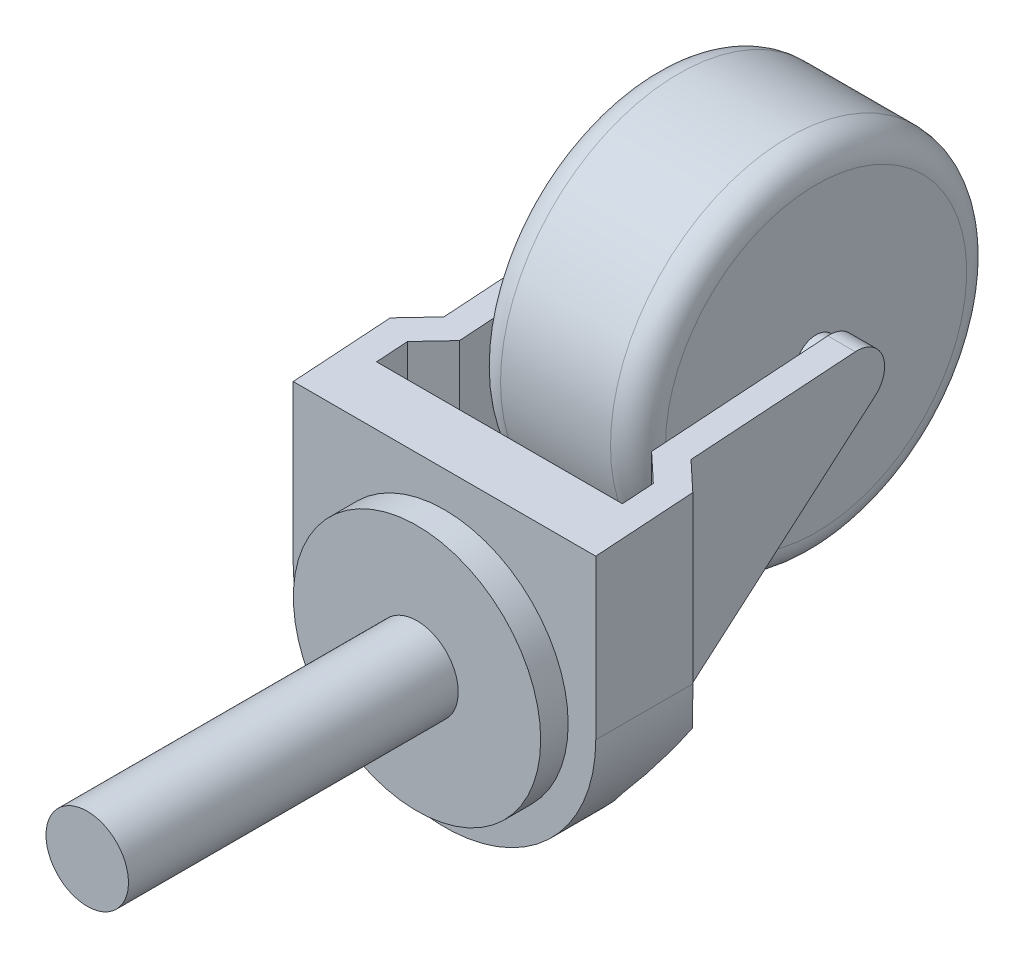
ISO-10303-21;
HEADER;
FILE_DESCRIPTION(('STEP AP214'),'2;1');
FILE_NAME('part.step','',(''),(''),'','','');
FILE_SCHEMA(('AUTOMOTIVE_DESIGN { 1 0 10303 214 1 1 1 1 }'));
ENDSEC;
DATA;
#1=APPLICATION_CONTEXT('core data for automotive mechanical design processes');
#2=APPLICATION_PROTOCOL_DEFINITION('international standard','automotive_design',2000,#1);
#3=PRODUCT_CONTEXT('',#1,'mechanical');
#4=PRODUCT('Part','Part','',(#3));
#5=PRODUCT_RELATED_PRODUCT_CATEGORY('part','',(#4));
#6=PRODUCT_DEFINITION_FORMATION('','',#4);
#7=PRODUCT_DEFINITION_CONTEXT('part definition',#1,'design');
#8=PRODUCT_DEFINITION('design','',#6,#7);
#9=PRODUCT_DEFINITION_SHAPE('','',#8);
#10=(LENGTH_UNIT() NAMED_UNIT(*) SI_UNIT(.MILLI.,.METRE.));
#11=(NAMED_UNIT(*) PLANE_ANGLE_UNIT() SI_UNIT($,.RADIAN.));
#12=(NAMED_UNIT(*) SI_UNIT($,.STERADIAN.) SOLID_ANGLE_UNIT());
#13=UNCERTAINTY_MEASURE_WITH_UNIT(LENGTH_MEASURE(1.E-05),#10,'distance_accuracy_value','');
#14=(GEOMETRIC_REPRESENTATION_CONTEXT(3) GLOBAL_UNCERTAINTY_ASSIGNED_CONTEXT((#13)) GLOBAL_UNIT_ASSIGNED_CONTEXT((#10,
#11,#12)) REPRESENTATION_CONTEXT('',''));
#15=CARTESIAN_POINT('',(0.,0.,0.));
#16=DIRECTION('',(0.,0.,1.));
#17=DIRECTION('',(1.,0.,0.));
#18=AXIS2_PLACEMENT_3D('',#15,#16,#17);
#19=CARTESIAN_POINT('',(-21.0056487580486,17.4625,-36.576));
#20=DIRECTION('',(1.,0.,0.));
#21=DIRECTION('',(0.,1.,0.));
#22=AXIS2_PLACEMENT_3D('',#19,#20,#21);
#23=CYLINDRICAL_SURFACE('',#22,2.38125);
#24=CARTESIAN_POINT('',(9.525,17.4625,-36.576));
#25=DIRECTION('',(1.,0.,0.));
#26=DIRECTION('',(0.,0.,-1.));
#27=AXIS2_PLACEMENT_3D('',#24,#25,#26);
#28=CIRCLE('',#27,2.38125);
#29=CARTESIAN_POINT('',(9.525,17.4625,-38.95725));
#30=VERTEX_POINT('',#29);
#31=EDGE_CURVE('E43',#30,#30,#28,.T.);
#32=ORIENTED_EDGE('',*,*,#31,.T.);
#33=EDGE_LOOP('',(#32));
#34=FACE_BOUND('',#33,.T.);
#35=CARTESIAN_POINT('',(11.0954566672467,17.4625,-36.576));
#36=DIRECTION('',(1.,0.,0.));
#37=DIRECTION('',(0.,0.,-1.));
#38=AXIS2_PLACEMENT_3D('',#35,#36,#37);
#39=CIRCLE('',#38,2.38125);
#40=CARTESIAN_POINT('',(11.0954566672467,17.4625,-38.95725));
#41=VERTEX_POINT('',#40);
#42=EDGE_CURVE('E38',#41,#41,#39,.F.);
#43=ORIENTED_EDGE('',*,*,#42,.T.);
#44=EDGE_LOOP('',(#43));
#45=FACE_BOUND('',#44,.T.);
#46=ADVANCED_FACE('F34',(#34,#45),#23,.T.);
#47=CARTESIAN_POINT('',(-9.525,17.4625,-36.576));
#48=DIRECTION('',(-1.,0.,0.));
#49=DIRECTION('',(0.,0.,1.));
#50=AXIS2_PLACEMENT_3D('',#47,#48,#49);
#51=CIRCLE('',#50,2.38125);
#52=CARTESIAN_POINT('',(-9.525,17.4625,-34.19475));
#53=VERTEX_POINT('',#52);
#54=EDGE_CURVE('E11',#53,#53,#51,.T.);
#55=ORIENTED_EDGE('',*,*,#54,.T.);
#56=EDGE_LOOP('',(#55));
#57=FACE_BOUND('',#56,.T.);
#58=CARTESIAN_POINT('',(-11.0954566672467,17.4625,-36.576));
#59=DIRECTION('',(-1.,0.,0.));
#60=DIRECTION('',(0.,0.,1.));
#61=AXIS2_PLACEMENT_3D('',#58,#59,#60);
#62=CIRCLE('',#61,2.38125);
#63=CARTESIAN_POINT('',(-11.0954566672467,17.4625,-34.19475));
#64=VERTEX_POINT('',#63);
#65=EDGE_CURVE('E221',#64,#64,#62,.F.);
#66=ORIENTED_EDGE('',*,*,#65,.T.);
#67=EDGE_LOOP('',(#66));
#68=FACE_BOUND('',#67,.T.);
#69=ADVANCED_FACE('F412',(#57,#68),#23,.T.);
#70=CARTESIAN_POINT('',(-6.35,17.4625,-36.576));
#71=DIRECTION('',(-1.,0.,0.));
#72=DIRECTION('',(0.,0.,1.));
#73=AXIS2_PLACEMENT_3D('',#70,#71,#72);
#74=TOROIDAL_SURFACE('',#73,17.399,3.175);
#75=CARTESIAN_POINT('',(-6.35,17.4625,-36.576));
#76=DIRECTION('',(-1.,0.,0.));
#77=DIRECTION('',(0.,0.,1.));
#78=AXIS2_PLACEMENT_3D('',#75,#76,#77);
#79=CIRCLE('',#78,20.574);
#80=CARTESIAN_POINT('',(-6.35,17.4625,-16.002));
#81=VERTEX_POINT('',#80);
#82=EDGE_CURVE('E223',#81,#81,#79,.T.);
#83=ORIENTED_EDGE('',*,*,#82,.T.);
#84=EDGE_LOOP('',(#83));
#85=FACE_BOUND('',#84,.T.);
#86=CARTESIAN_POINT('',(-9.525,17.4625,-36.576));
#87=DIRECTION('',(-1.,0.,0.));
#88=DIRECTION('',(0.,0.,1.));
#89=AXIS2_PLACEMENT_3D('',#86,#87,#88);
#90=CIRCLE('',#89,17.399);
#91=CARTESIAN_POINT('',(-9.525,17.4625,-19.177));
#92=VERTEX_POINT('',#91);
#93=EDGE_CURVE('E232',#92,#92,#90,.T.);
#94=ORIENTED_EDGE('',*,*,#93,.F.);
#95=EDGE_LOOP('',(#94));
#96=FACE_BOUND('',#95,.T.);
#97=ADVANCED_FACE('F36',(#85,#96),#74,.T.);
#98=CARTESIAN_POINT('',(-9.525,17.4625,-19.177));
#99=DIRECTION('',(-1.,0.,0.));
#100=DIRECTION('',(0.,0.,1.));
#101=AXIS2_PLACEMENT_3D('',#98,#99,#100);
#102=PLANE('',#101);
#103=ORIENTED_EDGE('',*,*,#54,.F.);
#104=EDGE_LOOP('',(#103));
#105=FACE_BOUND('',#104,.T.);
#106=ORIENTED_EDGE('',*,*,#93,.T.);
#107=EDGE_LOOP('',(#106));
#108=FACE_BOUND('',#107,.T.);
#109=ADVANCED_FACE('F433',(#105,#108),#102,.T.);
#110=CARTESIAN_POINT('',(9.525,17.4625,-19.177));
#111=DIRECTION('',(1.,0.,0.));
#112=DIRECTION('',(0.,0.,-1.));
#113=AXIS2_PLACEMENT_3D('',#110,#111,#112);
#114=PLANE('',#113);
#115=ORIENTED_EDGE('',*,*,#31,.F.);
#116=EDGE_LOOP('',(#115));
#117=FACE_BOUND('',#116,.T.);
#118=CARTESIAN_POINT('',(9.525,17.4625,-36.576));
#119=DIRECTION('',(-1.,0.,0.));
#120=DIRECTION('',(0.,0.,1.));
#121=AXIS2_PLACEMENT_3D('',#118,#119,#120);
#122=CIRCLE('',#121,17.399);
#123=CARTESIAN_POINT('',(9.525,17.4625,-19.177));
#124=VERTEX_POINT('',#123);
#125=EDGE_CURVE('E229',#124,#124,#122,.T.);
#126=ORIENTED_EDGE('',*,*,#125,.F.);
#127=EDGE_LOOP('',(#126));
#128=FACE_BOUND('',#127,.T.);
#129=ADVANCED_FACE('F430',(#117,#128),#114,.T.);
#130=CARTESIAN_POINT('',(6.34999999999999,17.4625,-36.576));
#131=DIRECTION('',(-1.,0.,0.));
#132=DIRECTION('',(0.,0.,1.));
#133=AXIS2_PLACEMENT_3D('',#130,#131,#132);
#134=TOROIDAL_SURFACE('',#133,17.399,3.175);
#135=ORIENTED_EDGE('',*,*,#125,.T.);
#136=EDGE_LOOP('',(#135));
#137=FACE_BOUND('',#136,.T.);
#138=CARTESIAN_POINT('',(6.34999999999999,17.4625,-36.576));
#139=DIRECTION('',(-1.,0.,0.));
#140=DIRECTION('',(0.,0.,1.));
#141=AXIS2_PLACEMENT_3D('',#138,#139,#140);
#142=CIRCLE('',#141,20.574);
#143=CARTESIAN_POINT('',(6.34999999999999,17.4625,-16.002));
#144=VERTEX_POINT('',#143);
#145=EDGE_CURVE('E226',#144,#144,#142,.T.);
#146=ORIENTED_EDGE('',*,*,#145,.F.);
#147=EDGE_LOOP('',(#146));
#148=FACE_BOUND('',#147,.T.);
#149=ADVANCED_FACE('F426',(#137,#148),#134,.T.);
#150=CARTESIAN_POINT('',(-14.2704566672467,17.4625,-36.576));
#151=DIRECTION('',(-1.,0.,0.));
#152=DIRECTION('',(0.,0.,1.));
#153=AXIS2_PLACEMENT_3D('',#150,#151,#152);
#154=CYLINDRICAL_SURFACE('',#153,20.574);
#155=ORIENTED_EDGE('',*,*,#145,.T.);
#156=EDGE_LOOP('',(#155));
#157=FACE_BOUND('',#156,.T.);
#158=ORIENTED_EDGE('',*,*,#82,.F.);
#159=EDGE_LOOP('',(#158));
#160=FACE_BOUND('',#159,.T.);
#161=ADVANCED_FACE('F422',(#157,#160),#154,.T.);
#162=CARTESIAN_POINT('',(0.,0.,38.1));
#163=DIRECTION('',(0.,0.,-1.));
#164=DIRECTION('',(-1.,0.,0.));
#165=AXIS2_PLACEMENT_3D('',#162,#163,#164);
#166=CYLINDRICAL_SURFACE('',#165,4.7625);
#167=CARTESIAN_POINT('',(0.,0.,38.1));
#168=DIRECTION('',(0.,0.,1.));
#169=DIRECTION('',(1.,0.,0.));
#170=AXIS2_PLACEMENT_3D('',#167,#168,#169);
#171=CIRCLE('',#170,4.7625);
#172=CARTESIAN_POINT('',(-4.7625,0.,38.1));
#173=VERTEX_POINT('',#172);
#174=EDGE_CURVE('E205',#173,#173,#171,.T.);
#175=CARTESIAN_POINT('',(0.,0.,0.));
#176=DIRECTION('',(0.,0.,1.));
#177=DIRECTION('',(1.,0.,0.));
#178=AXIS2_PLACEMENT_3D('',#175,#176,#177);
#179=CIRCLE('',#178,4.7625);
#180=CARTESIAN_POINT('',(-4.7625,0.,0.));
#181=VERTEX_POINT('',#180);
#182=EDGE_CURVE('E202',#181,#181,#179,.T.);
#183=CARTESIAN_POINT('',(-4.7625,0.,38.1));
#184=CARTESIAN_POINT('',(-4.7625,0.,37.703125));
#185=CARTESIAN_POINT('',(-4.7625,0.,37.30625));
#186=CARTESIAN_POINT('',(-4.7625,0.,36.5125));
#187=CARTESIAN_POINT('',(-4.7625,0.,36.115625));
#188=CARTESIAN_POINT('',(-4.7625,0.,35.321875));
#189=CARTESIAN_POINT('',(-4.7625,0.,34.925));
#190=CARTESIAN_POINT('',(-4.7625,0.,34.13125));
#191=CARTESIAN_POINT('',(-4.7625,0.,33.734375));
#192=CARTESIAN_POINT('',(-4.7625,0.,32.940625));
#193=CARTESIAN_POINT('',(-4.7625,0.,32.54375));
#194=CARTESIAN_POINT('',(-4.7625,0.,31.75));
#195=CARTESIAN_POINT('',(-4.7625,0.,31.353125));
#196=CARTESIAN_POINT('',(-4.7625,0.,30.559375));
#197=CARTESIAN_POINT('',(-4.7625,0.,30.1625));
#198=CARTESIAN_POINT('',(-4.7625,0.,29.36875));
#199=CARTESIAN_POINT('',(-4.7625,0.,28.971875));
#200=CARTESIAN_POINT('',(-4.7625,0.,28.178125));
#201=CARTESIAN_POINT('',(-4.7625,0.,27.78125));
#202=CARTESIAN_POINT('',(-4.7625,0.,26.9875));
#203=CARTESIAN_POINT('',(-4.7625,0.,26.590625));
#204=CARTESIAN_POINT('',(-4.7625,0.,25.796875));
#205=CARTESIAN_POINT('',(-4.7625,0.,25.4));
#206=CARTESIAN_POINT('',(-4.7625,0.,24.60625));
#207=CARTESIAN_POINT('',(-4.7625,0.,24.209375));
#208=CARTESIAN_POINT('',(-4.7625,0.,23.415625));
#209=CARTESIAN_POINT('',(-4.7625,0.,23.01875));
#210=CARTESIAN_POINT('',(-4.7625,0.,22.225));
#211=CARTESIAN_POINT('',(-4.7625,0.,21.828125));
#212=CARTESIAN_POINT('',(-4.7625,0.,21.034375));
#213=CARTESIAN_POINT('',(-4.7625,0.,20.6375));
#214=CARTESIAN_POINT('',(-4.7625,0.,19.84375));
#215=CARTESIAN_POINT('',(-4.7625,0.,19.446875));
#216=CARTESIAN_POINT('',(-4.7625,0.,18.653125));
#217=CARTESIAN_POINT('',(-4.7625,0.,18.25625));
#218=CARTESIAN_POINT('',(-4.7625,0.,17.4625));
#219=CARTESIAN_POINT('',(-4.7625,0.,17.065625));
#220=CARTESIAN_POINT('',(-4.7625,0.,16.271875));
#221=CARTESIAN_POINT('',(-4.7625,0.,15.875));
#222=CARTESIAN_POINT('',(-4.7625,0.,15.08125));
#223=CARTESIAN_POINT('',(-4.7625,0.,14.684375));
#224=CARTESIAN_POINT('',(-4.7625,0.,13.890625));
#225=CARTESIAN_POINT('',(-4.7625,0.,13.49375));
#226=CARTESIAN_POINT('',(-4.7625,0.,12.7));
#227=CARTESIAN_POINT('',(-4.7625,0.,12.303125));
#228=CARTESIAN_POINT('',(-4.7625,0.,11.509375));
#229=CARTESIAN_POINT('',(-4.7625,0.,11.1125));
#230=CARTESIAN_POINT('',(-4.7625,0.,10.31875));
#231=CARTESIAN_POINT('',(-4.7625,0.,9.92187499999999));
#232=CARTESIAN_POINT('',(-4.7625,0.,9.128125));
#233=CARTESIAN_POINT('',(-4.7625,0.,8.73124999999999));
#234=CARTESIAN_POINT('',(-4.7625,0.,7.93749999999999));
#235=CARTESIAN_POINT('',(-4.7625,0.,7.54062499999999));
#236=CARTESIAN_POINT('',(-4.7625,0.,6.746875));
#237=CARTESIAN_POINT('',(-4.7625,0.,6.35));
#238=CARTESIAN_POINT('',(-4.7625,0.,5.55625));
#239=CARTESIAN_POINT('',(-4.7625,0.,5.159375));
#240=CARTESIAN_POINT('',(-4.7625,0.,4.365625));
#241=CARTESIAN_POINT('',(-4.7625,0.,3.96875));
#242=CARTESIAN_POINT('',(-4.7625,0.,3.175));
#243=CARTESIAN_POINT('',(-4.7625,0.,2.778125));
#244=CARTESIAN_POINT('',(-4.7625,0.,1.984375));
#245=CARTESIAN_POINT('',(-4.7625,0.,1.5875));
#246=CARTESIAN_POINT('',(-4.7625,0.,0.79375));
#247=CARTESIAN_POINT('',(-4.7625,0.,0.396875));
#248=CARTESIAN_POINT('',(-4.7625,0.,0.));
#249=B_SPLINE_CURVE_WITH_KNOTS('',3,(#183,#184,#185,#186,#187,#188,#189,#190,#191,#192,#193,
#194,#195,#196,#197,#198,#199,#200,#201,#202,#203,#204,#205,#206,#207,#208,#209,#210,#211,#212,
#213,#214,#215,#216,#217,#218,#219,#220,#221,#222,#223,#224,#225,#226,#227,#228,#229,#230,#231,
#232,#233,#234,#235,#236,#237,#238,#239,#240,#241,#242,#243,#244,#245,#246,#247,#248),
.UNSPECIFIED.,.F.,.F.,(4,2,2,2,2,2,2,2,2,2,2,2,2,2,2,2,2,2,2,2,2,2,2,2,2,2,2,2,2,2,2,2,4),(0.,
1.190625,2.38125,3.571875,4.7625,5.953125,7.14375,8.334375,9.52500000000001,10.715625,11.90625,
13.096875,14.2875,15.478125,16.66875,17.859375,19.05,20.240625,21.43125,22.621875,23.8125,
25.003125,26.19375,27.384375,28.575,29.765625,30.95625,32.146875,33.3375,34.528125,35.71875,
36.909375,38.1),.UNSPECIFIED.);
#250=EDGE_CURVE('BSEAM425',#173,#181,#249,.T.);
#251=ORIENTED_EDGE('',*,*,#174,.F.);
#252=ORIENTED_EDGE('',*,*,#182,.T.);
#253=ORIENTED_EDGE('',*,*,#250,.T.);
#254=ORIENTED_EDGE('',*,*,#250,.F.);
#255=EDGE_LOOP('',(#251,#253,#252,#254));
#256=FACE_BOUND('',#255,.T.);
#257=ADVANCED_FACE('F425',(#256),#166,.T.);
#258=CARTESIAN_POINT('',(0.,0.,38.1));
#259=DIRECTION('',(0.,0.,1.));
#260=DIRECTION('',(1.,0.,0.));
#261=AXIS2_PLACEMENT_3D('',#258,#259,#260);
#262=PLANE('',#261);
#263=ORIENTED_EDGE('',*,*,#174,.T.);
#264=EDGE_LOOP('',(#263));
#265=FACE_BOUND('',#264,.T.);
#266=ADVANCED_FACE('F482',(#265),#262,.T.);
#267=CARTESIAN_POINT('',(0.,0.,0.));
#268=DIRECTION('',(0.,0.,1.));
#269=DIRECTION('',(1.,0.,0.));
#270=AXIS2_PLACEMENT_3D('',#267,#268,#269);
#271=PLANE('',#270);
#272=CARTESIAN_POINT('',(0.,0.,0.));
#273=DIRECTION('',(0.,0.,1.));
#274=DIRECTION('',(1.,0.,0.));
#275=AXIS2_PLACEMENT_3D('',#272,#273,#274);
#276=CIRCLE('',#275,14.2875);
#277=CARTESIAN_POINT('',(14.2875,0.,0.));
#278=VERTEX_POINT('',#277);
#279=EDGE_CURVE('E199',#278,#278,#276,.T.);
#280=ORIENTED_EDGE('',*,*,#279,.T.);
#281=EDGE_LOOP('',(#280));
#282=FACE_BOUND('',#281,.T.);
#283=ORIENTED_EDGE('',*,*,#182,.F.);
#284=EDGE_LOOP('',(#283));
#285=FACE_BOUND('',#284,.T.);
#286=ADVANCED_FACE('F493',(#282,#285),#271,.T.);
#287=CARTESIAN_POINT('',(0.,0.,-3.175));
#288=DIRECTION('',(0.,0.,1.));
#289=DIRECTION('',(1.,0.,0.));
#290=AXIS2_PLACEMENT_3D('',#287,#288,#289);
#291=CYLINDRICAL_SURFACE('',#290,14.2875);
#292=CARTESIAN_POINT('',(0.,0.,-3.175));
#293=DIRECTION('',(0.,0.,-1.));
#294=DIRECTION('',(-1.,0.,0.));
#295=AXIS2_PLACEMENT_3D('',#292,#293,#294);
#296=CIRCLE('',#295,14.2875);
#297=CARTESIAN_POINT('',(-14.2875,0.,-3.175));
#298=VERTEX_POINT('',#297);
#299=EDGE_CURVE('E196',#298,#298,#296,.F.);
#300=ORIENTED_EDGE('',*,*,#299,.T.);
#301=EDGE_LOOP('',(#300));
#302=FACE_BOUND('',#301,.T.);
#303=ORIENTED_EDGE('',*,*,#279,.F.);
#304=EDGE_LOOP('',(#303));
#305=FACE_BOUND('',#304,.T.);
#306=ADVANCED_FACE('F503',(#302,#305),#291,.T.);
#307=CARTESIAN_POINT('',(17.4752,20.6375,-39.751));
#308=DIRECTION('',(-1.,0.,0.));
#309=DIRECTION('',(0.,-1.,0.));
#310=AXIS2_PLACEMENT_3D('',#307,#308,#309);
#311=PLANE('',#310);
#312=DIRECTION('',(0.,1.,0.));
#313=VECTOR('',#312,1.);
#314=CARTESIAN_POINT('',(17.4752,20.6375,-14.3850440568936));
#315=LINE('',#314,#313);
#316=CARTESIAN_POINT('',(17.4752,0.,-14.3850440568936));
#317=VERTEX_POINT('',#316);
#318=CARTESIAN_POINT('',(17.4752,19.134924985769,-14.3850440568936));
#319=VERTEX_POINT('',#318);
#320=EDGE_CURVE('E180',#317,#319,#315,.T.);
#321=ORIENTED_EDGE('',*,*,#320,.T.);
#322=DIRECTION('',(0.,0.0678849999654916,-0.997693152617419));
#323=VECTOR('',#322,1.);
#324=CARTESIAN_POINT('',(17.4752,20.6301757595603,-36.3604651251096));
#325=LINE('',#324,#323);
#326=CARTESIAN_POINT('',(17.4752,18.3721715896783,-3.175));
#327=VERTEX_POINT('',#326);
#328=EDGE_CURVE('E164',#327,#319,#325,.T.);
#329=ORIENTED_EDGE('',*,*,#328,.F.);
#330=DIRECTION('',(0.,-1.,0.));
#331=VECTOR('',#330,1.);
#332=CARTESIAN_POINT('',(17.4752,20.6375,-3.175));
#333=LINE('',#332,#331);
#334=CARTESIAN_POINT('',(17.4752,0.,-3.175));
#335=VERTEX_POINT('',#334);
#336=EDGE_CURVE('E177',#327,#335,#333,.T.);
#337=ORIENTED_EDGE('',*,*,#336,.T.);
#338=DIRECTION('',(0.,0.,1.));
#339=VECTOR('',#338,1.);
#340=CARTESIAN_POINT('',(17.4752,0.,-39.751));
#341=LINE('',#340,#339);
#342=EDGE_CURVE('E194',#317,#335,#341,.T.);
#343=ORIENTED_EDGE('',*,*,#342,.F.);
#344=EDGE_LOOP('',(#321,#329,#337,#343));
#345=FACE_BOUND('',#344,.T.);
#346=ADVANCED_FACE('F175',(#345),#311,.F.);
#347=CARTESIAN_POINT('',(0.,0.,-39.751));
#348=DIRECTION('',(0.,0.,1.));
#349=DIRECTION('',(1.,0.,0.));
#350=AXIS2_PLACEMENT_3D('',#347,#348,#349);
#351=CYLINDRICAL_SURFACE('',#350,17.4752);
#352=CARTESIAN_POINT('',(0.,0.,-9.525));
#353=DIRECTION('',(0.,0.,1.));
#354=DIRECTION('',(1.,0.,0.));
#355=AXIS2_PLACEMENT_3D('',#352,#353,#354);
#356=CIRCLE('',#355,17.4752);
#357=CARTESIAN_POINT('',(-14.3002,-10.0442468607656,-9.525));
#358=VERTEX_POINT('',#357);
#359=CARTESIAN_POINT('',(14.3002,-10.0442468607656,-9.525));
#360=VERTEX_POINT('',#359);
#361=EDGE_CURVE('E210',#358,#360,#356,.T.);
#362=ORIENTED_EDGE('',*,*,#361,.T.);
#363=CARTESIAN_POINT('',(0.,0.,-21.1786462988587));
#364=DIRECTION('',(0.,0.75747424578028,0.652865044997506));
#365=DIRECTION('',(0.,-0.652865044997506,0.75747424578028));
#366=AXIS2_PLACEMENT_3D('',#363,#364,#365);
#367=ELLIPSE('',#366,26.7669407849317,17.4752);
#368=CARTESIAN_POINT('',(16.6792850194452,-5.21383412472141,-15.1293944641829));
#369=VERTEX_POINT('',#368);
#370=EDGE_CURVE('E318',#360,#369,#367,.T.);
#371=ORIENTED_EDGE('',*,*,#370,.T.);
#372=CARTESIAN_POINT('',(0.,0.,-30.7280864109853));
#373=DIRECTION('',(-0.683051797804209,0.,0.730369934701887));
#374=DIRECTION('',(0.730369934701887,0.,0.683051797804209));
#375=AXIS2_PLACEMENT_3D('',#372,#373,#374);
#376=ELLIPSE('',#375,23.9265051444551,17.4752);
#377=EDGE_CURVE('E212',#369,#317,#376,.T.);
#378=ORIENTED_EDGE('',*,*,#377,.T.);
#379=ORIENTED_EDGE('',*,*,#342,.T.);
#380=CARTESIAN_POINT('',(0.,0.,-3.175));
#381=DIRECTION('',(0.,0.,-1.));
#382=DIRECTION('',(-1.,0.,0.));
#383=AXIS2_PLACEMENT_3D('',#380,#381,#382);
#384=CIRCLE('',#383,17.4752);
#385=CARTESIAN_POINT('',(-17.4752,0.,-3.175));
#386=VERTEX_POINT('',#385);
#387=EDGE_CURVE('E184',#335,#386,#384,.T.);
#388=ORIENTED_EDGE('',*,*,#387,.T.);
#389=DIRECTION('',(0.,0.,1.));
#390=VECTOR('',#389,1.);
#391=CARTESIAN_POINT('',(-17.4752,0.,-39.751));
#392=LINE('',#391,#390);
#393=CARTESIAN_POINT('',(-17.4752,0.,-14.3850440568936));
#394=VERTEX_POINT('',#393);
#395=EDGE_CURVE('E59',#394,#386,#392,.T.);
#396=ORIENTED_EDGE('',*,*,#395,.F.);
#397=CARTESIAN_POINT('',(0.,0.,-30.7280864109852));
#398=DIRECTION('',(0.683051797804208,0.,0.730369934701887));
#399=DIRECTION('',(-0.730369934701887,0.,0.683051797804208));
#400=AXIS2_PLACEMENT_3D('',#397,#398,#399);
#401=ELLIPSE('',#400,23.926505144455,17.4752);
#402=CARTESIAN_POINT('',(-16.6792850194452,-5.2138341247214,-15.1293944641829));
#403=VERTEX_POINT('',#402);
#404=EDGE_CURVE('E188',#394,#403,#401,.T.);
#405=ORIENTED_EDGE('',*,*,#404,.T.);
#406=EDGE_CURVE('E314',#403,#358,#367,.T.);
#407=ORIENTED_EDGE('',*,*,#406,.T.);
#408=EDGE_LOOP('',(#362,#371,#378,#379,#388,#396,#405,#407));
#409=FACE_BOUND('',#408,.T.);
#410=ADVANCED_FACE('F360',(#409),#351,.T.);
#411=CARTESIAN_POINT('',(-17.4752,0.,-39.751));
#412=DIRECTION('',(1.,0.,0.));
#413=DIRECTION('',(0.,0.,-1.));
#414=AXIS2_PLACEMENT_3D('',#411,#412,#413);
#415=PLANE('',#414);
#416=DIRECTION('',(0.,1.,0.));
#417=VECTOR('',#416,1.);
#418=CARTESIAN_POINT('',(-17.4752,0.,-3.175));
#419=LINE('',#418,#417);
#420=CARTESIAN_POINT('',(-17.4752,18.3721715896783,-3.175));
#421=VERTEX_POINT('',#420);
#422=EDGE_CURVE('E186',#386,#421,#419,.T.);
#423=ORIENTED_EDGE('',*,*,#422,.T.);
#424=DIRECTION('',(0.,0.0678849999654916,-0.997693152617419));
#425=VECTOR('',#424,1.);
#426=CARTESIAN_POINT('',(-17.4752,20.6301757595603,-36.3604651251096));
#427=LINE('',#426,#425);
#428=CARTESIAN_POINT('',(-17.4752,19.134924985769,-14.3850440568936));
#429=VERTEX_POINT('',#428);
#430=EDGE_CURVE('E167',#421,#429,#427,.T.);
#431=ORIENTED_EDGE('',*,*,#430,.T.);
#432=DIRECTION('',(0.,-1.,0.));
#433=VECTOR('',#432,1.);
#434=CARTESIAN_POINT('',(-17.4752,0.,-14.3850440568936));
#435=LINE('',#434,#433);
#436=EDGE_CURVE('E208',#429,#394,#435,.T.);
#437=ORIENTED_EDGE('',*,*,#436,.T.);
#438=ORIENTED_EDGE('',*,*,#395,.T.);
#439=EDGE_LOOP('',(#423,#431,#437,#438));
#440=FACE_BOUND('',#439,.T.);
#441=ADVANCED_FACE('F401',(#440),#415,.F.);
#442=CARTESIAN_POINT('',(0.,0.,-3.175));
#443=DIRECTION('',(0.,0.,-1.));
#444=DIRECTION('',(-1.,0.,0.));
#445=AXIS2_PLACEMENT_3D('',#442,#443,#444);
#446=PLANE('',#445);
#447=ORIENTED_EDGE('',*,*,#299,.F.);
#448=EDGE_LOOP('',(#447));
#449=FACE_BOUND('',#448,.T.);
#450=ORIENTED_EDGE('',*,*,#336,.F.);
#451=DIRECTION('',(1.,0.,0.));
#452=VECTOR('',#451,1.);
#453=CARTESIAN_POINT('',(-17.4752,18.3721715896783,-3.175));
#454=LINE('',#453,#452);
#455=EDGE_CURVE('E161',#421,#327,#454,.T.);
#456=ORIENTED_EDGE('',*,*,#455,.F.);
#457=ORIENTED_EDGE('',*,*,#422,.F.);
#458=ORIENTED_EDGE('',*,*,#387,.F.);
#459=EDGE_LOOP('',(#450,#456,#457,#458));
#460=FACE_BOUND('',#459,.T.);
#461=ADVANCED_FACE('F183',(#449,#460),#446,.F.);
#462=CARTESIAN_POINT('',(11.0954566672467,-17.4752,-16.0043538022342));
#463=DIRECTION('',(1.,0.,0.));
#464=DIRECTION('',(0.,0.,-1.));
#465=AXIS2_PLACEMENT_3D('',#462,#463,#464);
#466=PLANE('',#465);
#467=ORIENTED_EDGE('',*,*,#42,.F.);
#468=EDGE_LOOP('',(#467));
#469=FACE_BOUND('',#468,.T.);
#470=CARTESIAN_POINT('',(11.0954566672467,17.4625,-36.576));
#471=DIRECTION('',(1.,0.,0.));
#472=DIRECTION('',(0.,0.,-1.));
#473=AXIS2_PLACEMENT_3D('',#470,#471,#472);
#474=CIRCLE('',#473,3.175);
#475=CARTESIAN_POINT('',(11.0954566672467,20.6301757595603,-36.3604651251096));
#476=VERTEX_POINT('',#475);
#477=CARTESIAN_POINT('',(11.0954566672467,15.0575192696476,-38.6488465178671));
#478=VERTEX_POINT('',#477);
#479=EDGE_CURVE('E250',#476,#478,#474,.F.);
#480=ORIENTED_EDGE('',*,*,#479,.T.);
#481=DIRECTION('',(0.,-0.652865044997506,0.75747424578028));
#482=VECTOR('',#481,1.);
#483=CARTESIAN_POINT('',(11.0954566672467,-10.00733773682,-9.56782310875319));
#484=LINE('',#483,#482);
#485=CARTESIAN_POINT('',(11.0954566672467,-4.45970899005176,-16.0043538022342));
#486=VERTEX_POINT('',#485);
#487=EDGE_CURVE('E253',#478,#486,#484,.T.);
#488=ORIENTED_EDGE('',*,*,#487,.T.);
#489=DIRECTION('',(0.,1.,0.));
#490=VECTOR('',#489,1.);
#491=CARTESIAN_POINT('',(11.0954566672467,-17.4752,-16.0043538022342));
#492=LINE('',#491,#490);
#493=CARTESIAN_POINT('',(11.0954566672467,19.2451059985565,-16.0043538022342));
#494=VERTEX_POINT('',#493);
#495=EDGE_CURVE('E354',#486,#494,#492,.T.);
#496=ORIENTED_EDGE('',*,*,#495,.T.);
#497=DIRECTION('',(0.,0.0678849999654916,-0.997693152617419));
#498=VECTOR('',#497,1.);
#499=CARTESIAN_POINT('',(11.0954566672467,19.075885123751,-13.5173462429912));
#500=LINE('',#499,#498);
#501=EDGE_CURVE('E255',#494,#476,#500,.T.);
#502=ORIENTED_EDGE('',*,*,#501,.T.);
#503=EDGE_LOOP('',(#480,#488,#496,#502));
#504=FACE_BOUND('',#503,.T.);
#505=ADVANCED_FACE('F243',(#469,#504),#466,.F.);
#506=CARTESIAN_POINT('',(14.1998109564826,-17.4752,-13.1011198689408));
#507=DIRECTION('',(0.683051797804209,0.,-0.730369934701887));
#508=DIRECTION('',(-0.730369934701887,0.,-0.683051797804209));
#509=AXIS2_PLACEMENT_3D('',#506,#507,#508);
#510=PLANE('',#509);
#511=ORIENTED_EDGE('',*,*,#495,.F.);
#512=DIRECTION('',(0.62939732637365,-0.507330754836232,0.588620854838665));
#513=VECTOR('',#512,1.);
#514=CARTESIAN_POINT('',(17.5568088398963,-9.66793364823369,-9.96161024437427));
#515=LINE('',#514,#513);
#516=CARTESIAN_POINT('',(14.1998109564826,-6.96199862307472,-13.1011198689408));
#517=VERTEX_POINT('',#516);
#518=EDGE_CURVE('E269',#486,#517,#515,.T.);
#519=ORIENTED_EDGE('',*,*,#518,.T.);
#520=DIRECTION('',(0.,1.,0.));
#521=VECTOR('',#520,1.);
#522=CARTESIAN_POINT('',(14.1998109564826,-17.4752,-13.1011198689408));
#523=LINE('',#522,#521);
#524=CARTESIAN_POINT('',(14.1998109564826,19.0475642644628,-13.1011198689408));
#525=VERTEX_POINT('',#524);
#526=EDGE_CURVE('E335',#517,#525,#523,.T.);
#527=ORIENTED_EDGE('',*,*,#526,.T.);
#528=DIRECTION('',(-0.729582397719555,0.0464260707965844,-0.682315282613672));
#529=VECTOR('',#528,1.);
#530=CARTESIAN_POINT('',(15.4368970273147,18.9688438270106,-11.9441803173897));
#531=LINE('',#530,#529);
#532=EDGE_CURVE('E305',#525,#494,#531,.T.);
#533=ORIENTED_EDGE('',*,*,#532,.T.);
#534=EDGE_LOOP('',(#511,#519,#527,#533));
#535=FACE_BOUND('',#534,.T.);
#536=ADVANCED_FACE('F246',(#535),#510,.F.);
#537=CARTESIAN_POINT('',(-11.0954566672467,-17.4752,-16.0043538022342));
#538=DIRECTION('',(-1.,0.,0.));
#539=DIRECTION('',(0.,0.,1.));
#540=AXIS2_PLACEMENT_3D('',#537,#538,#539);
#541=PLANE('',#540);
#542=ORIENTED_EDGE('',*,*,#65,.F.);
#543=EDGE_LOOP('',(#542));
#544=FACE_BOUND('',#543,.T.);
#545=DIRECTION('',(0.,1.,0.));
#546=VECTOR('',#545,1.);
#547=CARTESIAN_POINT('',(-11.0954566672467,-17.4752,-16.0043538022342));
#548=LINE('',#547,#546);
#549=CARTESIAN_POINT('',(-11.0954566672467,-4.45970899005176,-16.0043538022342));
#550=VERTEX_POINT('',#549);
#551=CARTESIAN_POINT('',(-11.0954566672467,19.2451059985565,-16.0043538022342));
#552=VERTEX_POINT('',#551);
#553=EDGE_CURVE('E345',#550,#552,#548,.T.);
#554=ORIENTED_EDGE('',*,*,#553,.F.);
#555=DIRECTION('',(0.,0.652865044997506,-0.75747424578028));
#556=VECTOR('',#555,1.);
#557=CARTESIAN_POINT('',(-11.0954566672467,-10.00733773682,-9.56782310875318));
#558=LINE('',#557,#556);
#559=CARTESIAN_POINT('',(-11.0954566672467,15.0575192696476,-38.6488465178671));
#560=VERTEX_POINT('',#559);
#561=EDGE_CURVE('E332',#550,#560,#558,.T.);
#562=ORIENTED_EDGE('',*,*,#561,.T.);
#563=CARTESIAN_POINT('',(-11.0954566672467,17.4625,-36.576));
#564=DIRECTION('',(-1.,0.,0.));
#565=DIRECTION('',(0.,0.,1.));
#566=AXIS2_PLACEMENT_3D('',#563,#564,#565);
#567=CIRCLE('',#566,3.175);
#568=CARTESIAN_POINT('',(-11.0954566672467,20.6301757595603,-36.3604651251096));
#569=VERTEX_POINT('',#568);
#570=EDGE_CURVE('E260',#560,#569,#567,.F.);
#571=ORIENTED_EDGE('',*,*,#570,.T.);
#572=DIRECTION('',(0.,-0.0678849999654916,0.997693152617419));
#573=VECTOR('',#572,1.);
#574=CARTESIAN_POINT('',(-11.0954566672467,19.075885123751,-13.5173462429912));
#575=LINE('',#574,#573);
#576=EDGE_CURVE('E302',#569,#552,#575,.T.);
#577=ORIENTED_EDGE('',*,*,#576,.T.);
#578=EDGE_LOOP('',(#554,#562,#571,#577));
#579=FACE_BOUND('',#578,.T.);
#580=ADVANCED_FACE('F376',(#544,#579),#541,.F.);
#581=CARTESIAN_POINT('',(-14.1998109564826,-17.4752,-13.1011198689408));
#582=DIRECTION('',(-0.683051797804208,0.,-0.730369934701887));
#583=DIRECTION('',(-0.730369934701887,0.,0.683051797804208));
#584=AXIS2_PLACEMENT_3D('',#581,#582,#583);
#585=PLANE('',#584);
#586=DIRECTION('',(0.,1.,0.));
#587=VECTOR('',#586,1.);
#588=CARTESIAN_POINT('',(-14.1998109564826,-17.4752,-13.1011198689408));
#589=LINE('',#588,#587);
#590=CARTESIAN_POINT('',(-14.1998109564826,-6.96199862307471,-13.1011198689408));
#591=VERTEX_POINT('',#590);
#592=CARTESIAN_POINT('',(-14.1998109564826,19.0475642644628,-13.1011198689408));
#593=VERTEX_POINT('',#592);
#594=EDGE_CURVE('E342',#591,#593,#589,.T.);
#595=ORIENTED_EDGE('',*,*,#594,.F.);
#596=DIRECTION('',(0.629397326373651,0.507330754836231,-0.588620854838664));
#597=VECTOR('',#596,1.);
#598=CARTESIAN_POINT('',(-17.5568088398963,-9.66793364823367,-9.96161024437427));
#599=LINE('',#598,#597);
#600=EDGE_CURVE('E329',#591,#550,#599,.T.);
#601=ORIENTED_EDGE('',*,*,#600,.T.);
#602=ORIENTED_EDGE('',*,*,#553,.T.);
#603=DIRECTION('',(-0.729582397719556,-0.0464260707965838,0.682315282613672));
#604=VECTOR('',#603,1.);
#605=CARTESIAN_POINT('',(-15.4368970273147,18.9688438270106,-11.9441803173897));
#606=LINE('',#605,#604);
#607=EDGE_CURVE('E299',#552,#593,#606,.T.);
#608=ORIENTED_EDGE('',*,*,#607,.T.);
#609=EDGE_LOOP('',(#595,#601,#602,#608));
#610=FACE_BOUND('',#609,.T.);
#611=ADVANCED_FACE('F379',(#610),#585,.F.);
#612=CARTESIAN_POINT('',(-14.1998109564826,-17.4752,-9.52499999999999));
#613=DIRECTION('',(-1.,0.,0.));
#614=DIRECTION('',(0.,0.,1.));
#615=AXIS2_PLACEMENT_3D('',#612,#613,#614);
#616=PLANE('',#615);
#617=DIRECTION('',(0.,1.,0.));
#618=VECTOR('',#617,1.);
#619=CARTESIAN_POINT('',(-14.1998109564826,-17.4752,-9.52499999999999));
#620=LINE('',#619,#618);
#621=CARTESIAN_POINT('',(-14.1998109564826,-10.0442468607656,-9.525));
#622=VERTEX_POINT('',#621);
#623=CARTESIAN_POINT('',(-14.1998109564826,18.8042380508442,-9.52499999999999));
#624=VERTEX_POINT('',#623);
#625=EDGE_CURVE('E339',#622,#624,#620,.T.);
#626=ORIENTED_EDGE('',*,*,#625,.F.);
#627=DIRECTION('',(0.,0.652865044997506,-0.75747424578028));
#628=VECTOR('',#627,1.);
#629=CARTESIAN_POINT('',(-14.1998109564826,-13.2115625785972,-5.85018220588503));
#630=LINE('',#629,#628);
#631=EDGE_CURVE('E270',#622,#591,#630,.T.);
#632=ORIENTED_EDGE('',*,*,#631,.T.);
#633=ORIENTED_EDGE('',*,*,#594,.T.);
#634=DIRECTION('',(0.,-0.0678849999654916,0.997693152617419));
#635=VECTOR('',#634,1.);
#636=CARTESIAN_POINT('',(-14.1998109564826,18.6370488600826,-7.06785172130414));
#637=LINE('',#636,#635);
#638=EDGE_CURVE('E296',#593,#624,#637,.T.);
#639=ORIENTED_EDGE('',*,*,#638,.T.);
#640=EDGE_LOOP('',(#626,#632,#633,#639));
#641=FACE_BOUND('',#640,.T.);
#642=ADVANCED_FACE('F383',(#641),#616,.F.);
#643=CARTESIAN_POINT('',(-14.1998109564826,-17.4752,-9.52499999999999));
#644=DIRECTION('',(0.,0.,1.));
#645=DIRECTION('',(1.,0.,0.));
#646=AXIS2_PLACEMENT_3D('',#643,#644,#645);
#647=PLANE('',#646);
#648=DIRECTION('',(0.,1.,0.));
#649=VECTOR('',#648,1.);
#650=CARTESIAN_POINT('',(14.1998109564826,-17.4752,-9.525));
#651=LINE('',#650,#649);
#652=CARTESIAN_POINT('',(14.1998109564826,-10.0442468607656,-9.525));
#653=VERTEX_POINT('',#652);
#654=CARTESIAN_POINT('',(14.1998109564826,18.8042380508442,-9.525));
#655=VERTEX_POINT('',#654);
#656=EDGE_CURVE('E336',#653,#655,#651,.T.);
#657=ORIENTED_EDGE('',*,*,#656,.F.);
#658=DIRECTION('',(1.,0.,0.));
#659=VECTOR('',#658,1.);
#660=CARTESIAN_POINT('',(-17.4752,-10.0442468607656,-9.525));
#661=LINE('',#660,#659);
#662=EDGE_CURVE('E276',#653,#360,#661,.T.);
#663=ORIENTED_EDGE('',*,*,#662,.T.);
#664=ORIENTED_EDGE('',*,*,#361,.F.);
#665=EDGE_CURVE('E285',#358,#622,#661,.T.);
#666=ORIENTED_EDGE('',*,*,#665,.T.);
#667=ORIENTED_EDGE('',*,*,#625,.T.);
#668=DIRECTION('',(1.,0.,0.));
#669=VECTOR('',#668,1.);
#670=CARTESIAN_POINT('',(-14.1998109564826,18.8042380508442,-9.52499999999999));
#671=LINE('',#670,#669);
#672=EDGE_CURVE('E293',#624,#655,#671,.T.);
#673=ORIENTED_EDGE('',*,*,#672,.T.);
#674=EDGE_LOOP('',(#657,#663,#664,#666,#667,#673));
#675=FACE_BOUND('',#674,.T.);
#676=ADVANCED_FACE('F386',(#675),#647,.F.);
#677=CARTESIAN_POINT('',(14.1998109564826,-17.4752,-9.525));
#678=DIRECTION('',(1.,0.,0.));
#679=DIRECTION('',(0.,0.,-1.));
#680=AXIS2_PLACEMENT_3D('',#677,#678,#679);
#681=PLANE('',#680);
#682=ORIENTED_EDGE('',*,*,#526,.F.);
#683=DIRECTION('',(0.,-0.652865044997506,0.75747424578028));
#684=VECTOR('',#683,1.);
#685=CARTESIAN_POINT('',(14.1998109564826,-13.2115625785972,-5.85018220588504));
#686=LINE('',#685,#684);
#687=EDGE_CURVE('E323',#517,#653,#686,.T.);
#688=ORIENTED_EDGE('',*,*,#687,.T.);
#689=ORIENTED_EDGE('',*,*,#656,.T.);
#690=DIRECTION('',(0.,0.0678849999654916,-0.997693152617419));
#691=VECTOR('',#690,1.);
#692=CARTESIAN_POINT('',(14.1998109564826,18.6370488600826,-7.06785172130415));
#693=LINE('',#692,#691);
#694=EDGE_CURVE('E290',#655,#525,#693,.T.);
#695=ORIENTED_EDGE('',*,*,#694,.T.);
#696=EDGE_LOOP('',(#682,#688,#689,#695));
#697=FACE_BOUND('',#696,.T.);
#698=ADVANCED_FACE('F392',(#697),#681,.F.);
#699=CARTESIAN_POINT('',(14.2704566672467,-17.4752,-17.3821631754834));
#700=DIRECTION('',(-0.683051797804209,0.,0.730369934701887));
#701=DIRECTION('',(0.730369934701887,0.,0.683051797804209));
#702=AXIS2_PLACEMENT_3D('',#699,#700,#701);
#703=PLANE('',#702);
#704=ORIENTED_EDGE('',*,*,#377,.F.);
#705=DIRECTION('',(-0.62939732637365,0.507330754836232,-0.588620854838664));
#706=VECTOR('',#705,1.);
#707=CARTESIAN_POINT('',(18.8056606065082,-6.92781619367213,-13.1407793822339));
#708=LINE('',#707,#706);
#709=CARTESIAN_POINT('',(14.2704566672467,-3.27217874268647,-17.3821631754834));
#710=VERTEX_POINT('',#709);
#711=EDGE_CURVE('E317',#369,#710,#708,.T.);
#712=ORIENTED_EDGE('',*,*,#711,.T.);
#713=DIRECTION('',(0.,1.,0.));
#714=VECTOR('',#713,1.);
#715=CARTESIAN_POINT('',(14.2704566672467,-17.4752,-17.3821631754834));
#716=LINE('',#715,#714);
#717=CARTESIAN_POINT('',(14.2704566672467,19.3388548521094,-17.3821631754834));
#718=VERTEX_POINT('',#717);
#719=EDGE_CURVE('E351',#710,#718,#716,.T.);
#720=ORIENTED_EDGE('',*,*,#719,.T.);
#721=DIRECTION('',(0.729582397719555,-0.0464260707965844,0.682315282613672));
#722=VECTOR('',#721,1.);
#723=CARTESIAN_POINT('',(15.5174092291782,19.2595065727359,-16.2159963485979));
#724=LINE('',#723,#722);
#725=EDGE_CURVE('E284',#718,#319,#724,.T.);
#726=ORIENTED_EDGE('',*,*,#725,.T.);
#727=ORIENTED_EDGE('',*,*,#320,.F.);
#728=EDGE_LOOP('',(#704,#712,#720,#726,#727));
#729=FACE_BOUND('',#728,.T.);
#730=ADVANCED_FACE('F400',(#729),#703,.F.);
#731=CARTESIAN_POINT('',(-14.2704566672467,-17.4752,-17.3821631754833));
#732=DIRECTION('',(0.683051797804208,0.,0.730369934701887));
#733=DIRECTION('',(0.730369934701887,0.,-0.683051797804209));
#734=AXIS2_PLACEMENT_3D('',#731,#732,#733);
#735=PLANE('',#734);
#736=DIRECTION('',(0.,1.,0.));
#737=VECTOR('',#736,1.);
#738=CARTESIAN_POINT('',(-14.2704566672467,-17.4752,-17.3821631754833));
#739=LINE('',#738,#737);
#740=CARTESIAN_POINT('',(-14.2704566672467,-3.27217874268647,-17.3821631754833));
#741=VERTEX_POINT('',#740);
#742=CARTESIAN_POINT('',(-14.2704566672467,19.3388548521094,-17.3821631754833));
#743=VERTEX_POINT('',#742);
#744=EDGE_CURVE('E348',#741,#743,#739,.T.);
#745=ORIENTED_EDGE('',*,*,#744,.F.);
#746=DIRECTION('',(-0.629397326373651,-0.507330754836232,0.588620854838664));
#747=VECTOR('',#746,1.);
#748=CARTESIAN_POINT('',(-18.8056606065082,-6.92781619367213,-13.1407793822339));
#749=LINE('',#748,#747);
#750=EDGE_CURVE('E310',#741,#403,#749,.T.);
#751=ORIENTED_EDGE('',*,*,#750,.T.);
#752=ORIENTED_EDGE('',*,*,#404,.F.);
#753=ORIENTED_EDGE('',*,*,#436,.F.);
#754=DIRECTION('',(0.729582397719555,0.0464260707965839,-0.682315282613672));
#755=VECTOR('',#754,1.);
#756=CARTESIAN_POINT('',(-15.5174092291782,19.259506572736,-16.2159963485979));
#757=LINE('',#756,#755);
#758=EDGE_CURVE('E281',#429,#743,#757,.T.);
#759=ORIENTED_EDGE('',*,*,#758,.T.);
#760=EDGE_LOOP('',(#745,#751,#752,#753,#759));
#761=FACE_BOUND('',#760,.T.);
#762=ADVANCED_FACE('F364',(#761),#735,.F.);
#763=CARTESIAN_POINT('',(-17.4752,15.0575192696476,-38.6488465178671));
#764=DIRECTION('',(0.,0.75747424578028,0.652865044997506));
#765=DIRECTION('',(0.,-0.652865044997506,0.75747424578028));
#766=AXIS2_PLACEMENT_3D('',#763,#764,#765);
#767=PLANE('',#766);
#768=ORIENTED_EDGE('',*,*,#600,.F.);
#769=ORIENTED_EDGE('',*,*,#631,.F.);
#770=ORIENTED_EDGE('',*,*,#665,.F.);
#771=ORIENTED_EDGE('',*,*,#406,.F.);
#772=ORIENTED_EDGE('',*,*,#750,.F.);
#773=DIRECTION('',(0.,-0.652865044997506,0.75747424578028));
#774=VECTOR('',#773,1.);
#775=CARTESIAN_POINT('',(-14.2704566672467,1.73605457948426,-23.1928705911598));
#776=LINE('',#775,#774);
#777=CARTESIAN_POINT('',(-14.2704566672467,15.0575192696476,-38.6488465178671));
#778=VERTEX_POINT('',#777);
#779=EDGE_CURVE('E219',#778,#741,#776,.T.);
#780=ORIENTED_EDGE('',*,*,#779,.F.);
#781=DIRECTION('',(1.,0.,0.));
#782=VECTOR('',#781,1.);
#783=CARTESIAN_POINT('',(-17.4752,15.0575192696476,-38.6488465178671));
#784=LINE('',#783,#782);
#785=EDGE_CURVE('E273',#778,#560,#784,.T.);
#786=ORIENTED_EDGE('',*,*,#785,.T.);
#787=ORIENTED_EDGE('',*,*,#561,.F.);
#788=EDGE_LOOP('',(#768,#769,#770,#771,#772,#780,#786,#787));
#789=FACE_BOUND('',#788,.T.);
#790=ADVANCED_FACE('F367',(#789),#767,.F.);
#791=CARTESIAN_POINT('',(14.2704566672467,15.0575192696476,-38.6488465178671));
#792=VERTEX_POINT('',#791);
#793=EDGE_CURVE('E266',#478,#792,#784,.T.);
#794=ORIENTED_EDGE('',*,*,#793,.T.);
#795=DIRECTION('',(0.,0.652865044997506,-0.75747424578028));
#796=VECTOR('',#795,1.);
#797=CARTESIAN_POINT('',(14.2704566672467,1.73605457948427,-23.1928705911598));
#798=LINE('',#797,#796);
#799=EDGE_CURVE('E321',#710,#792,#798,.T.);
#800=ORIENTED_EDGE('',*,*,#799,.F.);
#801=ORIENTED_EDGE('',*,*,#711,.F.);
#802=ORIENTED_EDGE('',*,*,#370,.F.);
#803=ORIENTED_EDGE('',*,*,#662,.F.);
#804=ORIENTED_EDGE('',*,*,#687,.F.);
#805=ORIENTED_EDGE('',*,*,#518,.F.);
#806=ORIENTED_EDGE('',*,*,#487,.F.);
#807=EDGE_LOOP('',(#794,#800,#801,#802,#803,#804,#805,#806));
#808=FACE_BOUND('',#807,.T.);
#809=ADVANCED_FACE('F265',(#808),#767,.F.);
#810=CARTESIAN_POINT('',(-17.4752,17.4625,-36.576));
#811=DIRECTION('',(1.,0.,0.));
#812=DIRECTION('',(0.,1.,0.));
#813=AXIS2_PLACEMENT_3D('',#810,#811,#812);
#814=CYLINDRICAL_SURFACE('',#813,3.175);
#815=ORIENTED_EDGE('',*,*,#570,.F.);
#816=ORIENTED_EDGE('',*,*,#785,.F.);
#817=CARTESIAN_POINT('',(-14.2704566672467,17.4625,-36.576));
#818=DIRECTION('',(1.,0.,0.));
#819=DIRECTION('',(0.,1.,0.));
#820=AXIS2_PLACEMENT_3D('',#817,#818,#819);
#821=CIRCLE('',#820,3.175);
#822=CARTESIAN_POINT('',(-14.2704566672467,20.6301757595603,-36.3604651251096));
#823=VERTEX_POINT('',#822);
#824=EDGE_CURVE('E217',#823,#778,#821,.F.);
#825=ORIENTED_EDGE('',*,*,#824,.F.);
#826=DIRECTION('',(1.,0.,0.));
#827=VECTOR('',#826,1.);
#828=CARTESIAN_POINT('',(-17.4752,20.6301757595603,-36.3604651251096));
#829=LINE('',#828,#827);
#830=EDGE_CURVE('E51',#823,#569,#829,.T.);
#831=ORIENTED_EDGE('',*,*,#830,.T.);
#832=EDGE_LOOP('',(#815,#816,#825,#831));
#833=FACE_BOUND('',#832,.T.);
#834=ADVANCED_FACE('F373',(#833),#814,.T.);
#835=CARTESIAN_POINT('',(14.2704566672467,17.4625,-36.576));
#836=DIRECTION('',(-1.,0.,0.));
#837=DIRECTION('',(0.,-1.,0.));
#838=AXIS2_PLACEMENT_3D('',#835,#836,#837);
#839=CIRCLE('',#838,3.175);
#840=CARTESIAN_POINT('',(14.2704566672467,20.6301757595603,-36.3604651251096));
#841=VERTEX_POINT('',#840);
#842=EDGE_CURVE('E261',#792,#841,#839,.F.);
#843=ORIENTED_EDGE('',*,*,#842,.F.);
#844=ORIENTED_EDGE('',*,*,#793,.F.);
#845=ORIENTED_EDGE('',*,*,#479,.F.);
#846=EDGE_CURVE('E171',#476,#841,#829,.T.);
#847=ORIENTED_EDGE('',*,*,#846,.T.);
#848=EDGE_LOOP('',(#843,#844,#845,#847));
#849=FACE_BOUND('',#848,.T.);
#850=ADVANCED_FACE('F272',(#849),#814,.T.);
#851=CARTESIAN_POINT('',(-17.4752,20.6301757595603,-36.3604651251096));
#852=DIRECTION('',(0.,-0.997693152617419,-0.0678849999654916));
#853=DIRECTION('',(0.,0.0678849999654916,-0.997693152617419));
#854=AXIS2_PLACEMENT_3D('',#851,#852,#853);
#855=PLANE('',#854);
#856=ORIENTED_EDGE('',*,*,#532,.F.);
#857=ORIENTED_EDGE('',*,*,#694,.F.);
#858=ORIENTED_EDGE('',*,*,#672,.F.);
#859=ORIENTED_EDGE('',*,*,#638,.F.);
#860=ORIENTED_EDGE('',*,*,#607,.F.);
#861=ORIENTED_EDGE('',*,*,#576,.F.);
#862=ORIENTED_EDGE('',*,*,#830,.F.);
#863=DIRECTION('',(0.,0.0678849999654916,-0.997693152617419));
#864=VECTOR('',#863,1.);
#865=CARTESIAN_POINT('',(-14.2704566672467,20.6842074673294,-37.1545590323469));
#866=LINE('',#865,#864);
#867=EDGE_CURVE('E214',#743,#823,#866,.T.);
#868=ORIENTED_EDGE('',*,*,#867,.F.);
#869=ORIENTED_EDGE('',*,*,#758,.F.);
#870=ORIENTED_EDGE('',*,*,#430,.F.);
#871=ORIENTED_EDGE('',*,*,#455,.T.);
#872=ORIENTED_EDGE('',*,*,#328,.T.);
#873=ORIENTED_EDGE('',*,*,#725,.F.);
#874=DIRECTION('',(0.,-0.0678849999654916,0.997693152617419));
#875=VECTOR('',#874,1.);
#876=CARTESIAN_POINT('',(14.2704566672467,20.6842074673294,-37.154559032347));
#877=LINE('',#876,#875);
#878=EDGE_CURVE('E287',#841,#718,#877,.T.);
#879=ORIENTED_EDGE('',*,*,#878,.F.);
#880=ORIENTED_EDGE('',*,*,#846,.F.);
#881=ORIENTED_EDGE('',*,*,#501,.F.);
#882=EDGE_LOOP('',(#856,#857,#858,#859,#860,#861,#862,#868,#869,#870,#871,#872,#873,#879,#880,#881));
#883=FACE_BOUND('',#882,.T.);
#884=ADVANCED_FACE('F163',(#883),#855,.F.);
#885=CARTESIAN_POINT('',(14.2704566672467,17.4625,-36.576));
#886=DIRECTION('',(1.,0.,0.));
#887=DIRECTION('',(0.,1.,0.));
#888=AXIS2_PLACEMENT_3D('',#885,#886,#887);
#889=PLANE('',#888);
#890=ORIENTED_EDGE('',*,*,#719,.F.);
#891=ORIENTED_EDGE('',*,*,#799,.T.);
#892=ORIENTED_EDGE('',*,*,#842,.T.);
#893=ORIENTED_EDGE('',*,*,#878,.T.);
#894=EDGE_LOOP('',(#890,#891,#892,#893));
#895=FACE_BOUND('',#894,.T.);
#896=ADVANCED_FACE('F397',(#895),#889,.T.);
#897=CARTESIAN_POINT('',(-14.2704566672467,-17.4752,-39.751));
#898=DIRECTION('',(1.,0.,0.));
#899=DIRECTION('',(0.,1.,0.));
#900=AXIS2_PLACEMENT_3D('',#897,#898,#899);
#901=PLANE('',#900);
#902=ORIENTED_EDGE('',*,*,#824,.T.);
#903=ORIENTED_EDGE('',*,*,#779,.T.);
#904=ORIENTED_EDGE('',*,*,#744,.T.);
#905=ORIENTED_EDGE('',*,*,#867,.T.);
#906=EDGE_LOOP('',(#902,#903,#904,#905));
#907=FACE_BOUND('',#906,.T.);
#908=ADVANCED_FACE('F371',(#907),#901,.F.);
#909=CLOSED_SHELL('',(#46,#69,#97,#109,#129,#149,#161,#257,#266,#286,#306,#346,#410,#441,#461,
#505,#536,#580,#611,#642,#676,#698,#730,#762,#790,#809,#834,#850,#884,#896,#908));
#910=MANIFOLD_SOLID_BREP('B2',#909);
#911=ADVANCED_BREP_SHAPE_REPRESENTATION('',(#18,#910),#14);
#912=SHAPE_DEFINITION_REPRESENTATION(#9,#911);
ENDSEC;
END-ISO-10303-21;
